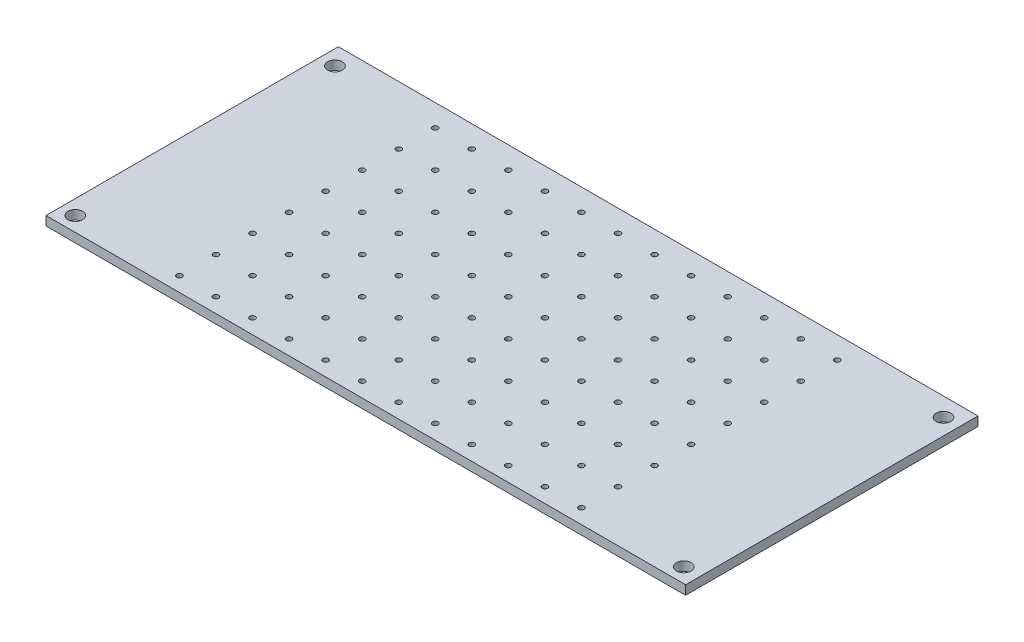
from build123d import *

# Parameters (mm, degrees)
CROQUIS1_W                = 350
CROQUIS1_H                = 160
SALIENTE_EXTRUIR1_DEPTH   = 5
CROQUIS2_R                = 1.5
CORTAR_EXTRUIR1_DEPTH     = 5
MATRIZL1_COUNT            = 12
MATRIZL1_PITCH            = 20
MATRIZL2_COUNT            = 8
MATRIZL2_PITCH            = 20
MATRIZL2_COPY_1_SKETCH_R  = 1.5
MATRIZL2_COPY_1_DEPTH     = 5
MATRIZL2_COPY_2_SKETCH_R  = 1.5
MATRIZL2_COPY_2_DEPTH     = 5
MATRIZL2_COPY_3_SKETCH_R  = 1.5
MATRIZL2_COPY_3_DEPTH     = 5
MATRIZL2_COPY_4_SKETCH_R  = 1.5
MATRIZL2_COPY_4_DEPTH     = 5
MATRIZL2_COPY_5_SKETCH_R  = 1.5
MATRIZL2_COPY_5_DEPTH     = 5
MATRIZL2_COPY_6_SKETCH_R  = 1.5
MATRIZL2_COPY_6_DEPTH     = 5
MATRIZL2_COPY_7_SKETCH_R  = 1.5
MATRIZL2_COPY_7_DEPTH     = 5
MATRIZL2_COPY_8_SKETCH_R  = 1.5
MATRIZL2_COPY_8_DEPTH     = 5
MATRIZL2_COPY_9_SKETCH_R  = 1.5
MATRIZL2_COPY_9_DEPTH     = 5
MATRIZL2_COPY_10_SKETCH_R = 1.5
MATRIZL2_COPY_10_DEPTH    = 5
MATRIZL2_COPY_11_SKETCH_R = 1.5
MATRIZL2_COPY_11_DEPTH    = 5
MATRIZL2_COPY_12_SKETCH_R = 1.5
MATRIZL2_COPY_12_DEPTH    = 5
MATRIZL2_COPY_13_SKETCH_R = 1.5
MATRIZL2_COPY_13_DEPTH    = 5
MATRIZL2_COPY_14_SKETCH_R = 1.5
MATRIZL2_COPY_14_DEPTH    = 5
MATRIZL2_COPY_15_SKETCH_R = 1.5
MATRIZL2_COPY_15_DEPTH    = 5
MATRIZL2_COPY_16_SKETCH_R = 1.5
MATRIZL2_COPY_16_DEPTH    = 5
MATRIZL2_COPY_17_SKETCH_R = 1.5
MATRIZL2_COPY_17_DEPTH    = 5
MATRIZL2_COPY_18_SKETCH_R = 1.5
MATRIZL2_COPY_18_DEPTH    = 5
MATRIZL2_COPY_19_SKETCH_R = 1.5
MATRIZL2_COPY_19_DEPTH    = 5
MATRIZL2_COPY_20_SKETCH_R = 1.5
MATRIZL2_COPY_20_DEPTH    = 5
MATRIZL2_COPY_21_SKETCH_R = 1.5
MATRIZL2_COPY_21_DEPTH    = 5
MATRIZL2_COPY_22_SKETCH_R = 1.5
MATRIZL2_COPY_22_DEPTH    = 5
MATRIZL2_COPY_23_SKETCH_R = 1.5
MATRIZL2_COPY_23_DEPTH    = 5
MATRIZL2_COPY_24_SKETCH_R = 1.5
MATRIZL2_COPY_24_DEPTH    = 5
MATRIZL2_COPY_25_SKETCH_R = 1.5
MATRIZL2_COPY_25_DEPTH    = 5
MATRIZL2_COPY_26_SKETCH_R = 1.5
MATRIZL2_COPY_26_DEPTH    = 5
MATRIZL2_COPY_27_SKETCH_R = 1.5
MATRIZL2_COPY_27_DEPTH    = 5
MATRIZL2_COPY_28_SKETCH_R = 1.5
MATRIZL2_COPY_28_DEPTH    = 5
MATRIZL2_COPY_29_SKETCH_R = 1.5
MATRIZL2_COPY_29_DEPTH    = 5
MATRIZL2_COPY_30_SKETCH_R = 1.5
MATRIZL2_COPY_30_DEPTH    = 5
MATRIZL2_COPY_31_SKETCH_R = 1.5
MATRIZL2_COPY_31_DEPTH    = 5
MATRIZL2_COPY_32_SKETCH_R = 1.5
MATRIZL2_COPY_32_DEPTH    = 5
MATRIZL2_COPY_33_SKETCH_R = 1.5
MATRIZL2_COPY_33_DEPTH    = 5
MATRIZL2_COPY_34_SKETCH_R = 1.5
MATRIZL2_COPY_34_DEPTH    = 5
MATRIZL2_COPY_35_SKETCH_R = 1.5
MATRIZL2_COPY_35_DEPTH    = 5
MATRIZL2_COPY_36_SKETCH_R = 1.5
MATRIZL2_COPY_36_DEPTH    = 5
MATRIZL2_COPY_37_SKETCH_R = 1.5
MATRIZL2_COPY_37_DEPTH    = 5
MATRIZL2_COPY_38_SKETCH_R = 1.5
MATRIZL2_COPY_38_DEPTH    = 5
MATRIZL2_COPY_39_SKETCH_R = 1.5
MATRIZL2_COPY_39_DEPTH    = 5
MATRIZL2_COPY_40_SKETCH_R = 1.5
MATRIZL2_COPY_40_DEPTH    = 5
MATRIZL2_COPY_41_SKETCH_R = 1.5
MATRIZL2_COPY_41_DEPTH    = 5
MATRIZL2_COPY_42_SKETCH_R = 1.5
MATRIZL2_COPY_42_DEPTH    = 5
MATRIZL2_COPY_43_SKETCH_R = 1.5
MATRIZL2_COPY_43_DEPTH    = 5
MATRIZL2_COPY_44_SKETCH_R = 1.5
MATRIZL2_COPY_44_DEPTH    = 5
MATRIZL2_COPY_45_SKETCH_R = 1.5
MATRIZL2_COPY_45_DEPTH    = 5
MATRIZL2_COPY_46_SKETCH_R = 1.5
MATRIZL2_COPY_46_DEPTH    = 5
MATRIZL2_COPY_47_SKETCH_R = 1.5
MATRIZL2_COPY_47_DEPTH    = 5
MATRIZL2_COPY_48_SKETCH_R = 1.5
MATRIZL2_COPY_48_DEPTH    = 5
MATRIZL2_COPY_49_SKETCH_R = 1.5
MATRIZL2_COPY_49_DEPTH    = 5
MATRIZL2_COPY_50_SKETCH_R = 1.5
MATRIZL2_COPY_50_DEPTH    = 5
MATRIZL2_COPY_51_SKETCH_R = 1.5
MATRIZL2_COPY_51_DEPTH    = 5
MATRIZL2_COPY_52_SKETCH_R = 1.5
MATRIZL2_COPY_52_DEPTH    = 5
MATRIZL2_COPY_53_SKETCH_R = 1.5
MATRIZL2_COPY_53_DEPTH    = 5
MATRIZL2_COPY_54_SKETCH_R = 1.5
MATRIZL2_COPY_54_DEPTH    = 5
MATRIZL2_COPY_55_SKETCH_R = 1.5
MATRIZL2_COPY_55_DEPTH    = 5
MATRIZL2_COPY_56_SKETCH_R = 1.5
MATRIZL2_COPY_56_DEPTH    = 5
MATRIZL2_COPY_57_SKETCH_R = 1.5
MATRIZL2_COPY_57_DEPTH    = 5
MATRIZL2_COPY_58_SKETCH_R = 1.5
MATRIZL2_COPY_58_DEPTH    = 5
MATRIZL2_COPY_59_SKETCH_R = 1.5
MATRIZL2_COPY_59_DEPTH    = 5
MATRIZL2_COPY_60_SKETCH_R = 1.5
MATRIZL2_COPY_60_DEPTH    = 5
MATRIZL2_COPY_61_SKETCH_R = 1.5
MATRIZL2_COPY_61_DEPTH    = 5
MATRIZL2_COPY_62_SKETCH_R = 1.5
MATRIZL2_COPY_62_DEPTH    = 5
MATRIZL2_COPY_63_SKETCH_R = 1.5
MATRIZL2_COPY_63_DEPTH    = 5
MATRIZL2_COPY_64_SKETCH_R = 1.5
MATRIZL2_COPY_64_DEPTH    = 5
MATRIZL2_COPY_65_SKETCH_R = 1.5
MATRIZL2_COPY_65_DEPTH    = 5
MATRIZL2_COPY_66_SKETCH_R = 1.5
MATRIZL2_COPY_66_DEPTH    = 5
MATRIZL2_COPY_67_SKETCH_R = 1.5
MATRIZL2_COPY_67_DEPTH    = 5
MATRIZL2_COPY_68_SKETCH_R = 1.5
MATRIZL2_COPY_68_DEPTH    = 5
MATRIZL2_COPY_69_SKETCH_R = 1.5
MATRIZL2_COPY_69_DEPTH    = 5
MATRIZL2_COPY_70_SKETCH_R = 1.5
MATRIZL2_COPY_70_DEPTH    = 5
MATRIZL2_COPY_71_SKETCH_R = 1.5
MATRIZL2_COPY_71_DEPTH    = 5
MATRIZL2_COPY_72_SKETCH_R = 1.5
MATRIZL2_COPY_72_DEPTH    = 5
MATRIZL2_COPY_73_SKETCH_R = 1.5
MATRIZL2_COPY_73_DEPTH    = 5
MATRIZL2_COPY_74_SKETCH_R = 1.5
MATRIZL2_COPY_74_DEPTH    = 5
MATRIZL2_COPY_75_SKETCH_R = 1.5
MATRIZL2_COPY_75_DEPTH    = 5
MATRIZL2_COPY_76_SKETCH_R = 1.5
MATRIZL2_COPY_76_DEPTH    = 5
MATRIZL2_COPY_77_SKETCH_R = 1.5
MATRIZL2_COPY_77_DEPTH    = 5
CROQUIS3_R                = 4
CORTAR_EXTRUIR2_DEPTH     = 5
CROQUIS5_R                = 4
CORTAR_EXTRUIR3_DEPTH     = 5
MATRIZL3_COUNT            = 2
MATRIZL3_PITCH            = 333


with BuildPart() as part:
    # Croquis1 → Saliente-Extruir1 (new body)
    with BuildSketch(Plane(origin=(0, 0, 0), x_dir=(1, 0, 0), z_dir=(0, 1, 0))):
        Rectangle(CROQUIS1_W, CROQUIS1_H)
    extrude(amount=SALIENTE_EXTRUIR1_DEPTH)

    # Croquis2 → Cortar-Extruir1 (cut)
    with BuildSketch(Plane(origin=(0, 5, 0), x_dir=(1, 0, 0), z_dir=(0, 1, 0))):
        with Locations(Location((-110, 68, 0), (0, 0, 270))):
            Circle(CROQUIS2_R)
    cortar_extruir1 = extrude(amount=-CORTAR_EXTRUIR1_DEPTH, mode=Mode.SUBTRACT)

    # MatrizL1: Cortar-Extruir1 ×12
    with Locations(*[(i * MATRIZL1_PITCH, 0, 0) for i in range(1, MATRIZL1_COUNT)]):
        add(cortar_extruir1, mode=Mode.SUBTRACT)

    # MatrizL2: Cortar-Extruir1 ×8
    with Locations(*[(0, 0, i * MATRIZL2_PITCH) for i in range(1, MATRIZL2_COUNT)]):
        add(cortar_extruir1, mode=Mode.SUBTRACT)

    # MatrizL2 copy 1 sketch → MatrizL2 copy 1 (cut)
    with BuildSketch(Plane(origin=(20, 5, 20), x_dir=(1, 0, 0), z_dir=(0, 1, 0))):
        with Locations(Location((-110, 68, 0), (0, 0, 270))):
            Circle(MATRIZL2_COPY_1_SKETCH_R)
    extrude(amount=-MATRIZL2_COPY_1_DEPTH, mode=Mode.SUBTRACT)

    # MatrizL2 copy 2 sketch → MatrizL2 copy 2 (cut)
    with BuildSketch(Plane(origin=(20, 5, 40), x_dir=(1, 0, 0), z_dir=(0, 1, 0))):
        with Locations(Location((-110, 68, 0), (0, 0, 270))):
            Circle(MATRIZL2_COPY_2_SKETCH_R)
    extrude(amount=-MATRIZL2_COPY_2_DEPTH, mode=Mode.SUBTRACT)

    # MatrizL2 copy 3 sketch → MatrizL2 copy 3 (cut)
    with BuildSketch(Plane(origin=(20, 5, 60), x_dir=(1, 0, 0), z_dir=(0, 1, 0))):
        with Locations(Location((-110, 68, 0), (0, 0, 270))):
            Circle(MATRIZL2_COPY_3_SKETCH_R)
    extrude(amount=-MATRIZL2_COPY_3_DEPTH, mode=Mode.SUBTRACT)

    # MatrizL2 copy 4 sketch → MatrizL2 copy 4 (cut)
    with BuildSketch(Plane(origin=(20, 5, 80), x_dir=(1, 0, 0), z_dir=(0, 1, 0))):
        with Locations(Location((-110, 68, 0), (0, 0, 270))):
            Circle(MATRIZL2_COPY_4_SKETCH_R)
    extrude(amount=-MATRIZL2_COPY_4_DEPTH, mode=Mode.SUBTRACT)

    # MatrizL2 copy 5 sketch → MatrizL2 copy 5 (cut)
    with BuildSketch(Plane(origin=(20, 5, 100), x_dir=(1, 0, 0), z_dir=(0, 1, 0))):
        with Locations(Location((-110, 68, 0), (0, 0, 270))):
            Circle(MATRIZL2_COPY_5_SKETCH_R)
    extrude(amount=-MATRIZL2_COPY_5_DEPTH, mode=Mode.SUBTRACT)

    # MatrizL2 copy 6 sketch → MatrizL2 copy 6 (cut)
    with BuildSketch(Plane(origin=(20, 5, 120), x_dir=(1, 0, 0), z_dir=(0, 1, 0))):
        with Locations(Location((-110, 68, 0), (0, 0, 270))):
            Circle(MATRIZL2_COPY_6_SKETCH_R)
    extrude(amount=-MATRIZL2_COPY_6_DEPTH, mode=Mode.SUBTRACT)

    # MatrizL2 copy 7 sketch → MatrizL2 copy 7 (cut)
    with BuildSketch(Plane(origin=(20, 5, 140), x_dir=(1, 0, 0), z_dir=(0, 1, 0))):
        with Locations(Location((-110, 68, 0), (0, 0, 270))):
            Circle(MATRIZL2_COPY_7_SKETCH_R)
    extrude(amount=-MATRIZL2_COPY_7_DEPTH, mode=Mode.SUBTRACT)

    # MatrizL2 copy 8 sketch → MatrizL2 copy 8 (cut)
    with BuildSketch(Plane(origin=(40, 5, 20), x_dir=(1, 0, 0), z_dir=(0, 1, 0))):
        with Locations(Location((-110, 68, 0), (0, 0, 270))):
            Circle(MATRIZL2_COPY_8_SKETCH_R)
    extrude(amount=-MATRIZL2_COPY_8_DEPTH, mode=Mode.SUBTRACT)

    # MatrizL2 copy 9 sketch → MatrizL2 copy 9 (cut)
    with BuildSketch(Plane(origin=(40, 5, 40), x_dir=(1, 0, 0), z_dir=(0, 1, 0))):
        with Locations(Location((-110, 68, 0), (0, 0, 270))):
            Circle(MATRIZL2_COPY_9_SKETCH_R)
    extrude(amount=-MATRIZL2_COPY_9_DEPTH, mode=Mode.SUBTRACT)

    # MatrizL2 copy 10 sketch → MatrizL2 copy 10 (cut)
    with BuildSketch(Plane(origin=(40, 5, 60), x_dir=(1, 0, 0), z_dir=(0, 1, 0))):
        with Locations(Location((-110, 68, 0), (0, 0, 270))):
            Circle(MATRIZL2_COPY_10_SKETCH_R)
    extrude(amount=-MATRIZL2_COPY_10_DEPTH, mode=Mode.SUBTRACT)

    # MatrizL2 copy 11 sketch → MatrizL2 copy 11 (cut)
    with BuildSketch(Plane(origin=(40, 5, 80), x_dir=(1, 0, 0), z_dir=(0, 1, 0))):
        with Locations(Location((-110, 68, 0), (0, 0, 270))):
            Circle(MATRIZL2_COPY_11_SKETCH_R)
    extrude(amount=-MATRIZL2_COPY_11_DEPTH, mode=Mode.SUBTRACT)

    # MatrizL2 copy 12 sketch → MatrizL2 copy 12 (cut)
    with BuildSketch(Plane(origin=(40, 5, 100), x_dir=(1, 0, 0), z_dir=(0, 1, 0))):
        with Locations(Location((-110, 68, 0), (0, 0, 270))):
            Circle(MATRIZL2_COPY_12_SKETCH_R)
    extrude(amount=-MATRIZL2_COPY_12_DEPTH, mode=Mode.SUBTRACT)

    # MatrizL2 copy 13 sketch → MatrizL2 copy 13 (cut)
    with BuildSketch(Plane(origin=(40, 5, 120), x_dir=(1, 0, 0), z_dir=(0, 1, 0))):
        with Locations(Location((-110, 68, 0), (0, 0, 270))):
            Circle(MATRIZL2_COPY_13_SKETCH_R)
    extrude(amount=-MATRIZL2_COPY_13_DEPTH, mode=Mode.SUBTRACT)

    # MatrizL2 copy 14 sketch → MatrizL2 copy 14 (cut)
    with BuildSketch(Plane(origin=(40, 5, 140), x_dir=(1, 0, 0), z_dir=(0, 1, 0))):
        with Locations(Location((-110, 68, 0), (0, 0, 270))):
            Circle(MATRIZL2_COPY_14_SKETCH_R)
    extrude(amount=-MATRIZL2_COPY_14_DEPTH, mode=Mode.SUBTRACT)

    # MatrizL2 copy 15 sketch → MatrizL2 copy 15 (cut)
    with BuildSketch(Plane(origin=(60, 5, 20), x_dir=(1, 0, 0), z_dir=(0, 1, 0))):
        with Locations(Location((-110, 68, 0), (0, 0, 270))):
            Circle(MATRIZL2_COPY_15_SKETCH_R)
    extrude(amount=-MATRIZL2_COPY_15_DEPTH, mode=Mode.SUBTRACT)

    # MatrizL2 copy 16 sketch → MatrizL2 copy 16 (cut)
    with BuildSketch(Plane(origin=(60, 5, 40), x_dir=(1, 0, 0), z_dir=(0, 1, 0))):
        with Locations(Location((-110, 68, 0), (0, 0, 270))):
            Circle(MATRIZL2_COPY_16_SKETCH_R)
    extrude(amount=-MATRIZL2_COPY_16_DEPTH, mode=Mode.SUBTRACT)

    # MatrizL2 copy 17 sketch → MatrizL2 copy 17 (cut)
    with BuildSketch(Plane(origin=(60, 5, 60), x_dir=(1, 0, 0), z_dir=(0, 1, 0))):
        with Locations(Location((-110, 68, 0), (0, 0, 270))):
            Circle(MATRIZL2_COPY_17_SKETCH_R)
    extrude(amount=-MATRIZL2_COPY_17_DEPTH, mode=Mode.SUBTRACT)

    # MatrizL2 copy 18 sketch → MatrizL2 copy 18 (cut)
    with BuildSketch(Plane(origin=(60, 5, 80), x_dir=(1, 0, 0), z_dir=(0, 1, 0))):
        with Locations(Location((-110, 68, 0), (0, 0, 270))):
            Circle(MATRIZL2_COPY_18_SKETCH_R)
    extrude(amount=-MATRIZL2_COPY_18_DEPTH, mode=Mode.SUBTRACT)

    # MatrizL2 copy 19 sketch → MatrizL2 copy 19 (cut)
    with BuildSketch(Plane(origin=(60, 5, 100), x_dir=(1, 0, 0), z_dir=(0, 1, 0))):
        with Locations(Location((-110, 68, 0), (0, 0, 270))):
            Circle(MATRIZL2_COPY_19_SKETCH_R)
    extrude(amount=-MATRIZL2_COPY_19_DEPTH, mode=Mode.SUBTRACT)

    # MatrizL2 copy 20 sketch → MatrizL2 copy 20 (cut)
    with BuildSketch(Plane(origin=(60, 5, 120), x_dir=(1, 0, 0), z_dir=(0, 1, 0))):
        with Locations(Location((-110, 68, 0), (0, 0, 270))):
            Circle(MATRIZL2_COPY_20_SKETCH_R)
    extrude(amount=-MATRIZL2_COPY_20_DEPTH, mode=Mode.SUBTRACT)

    # MatrizL2 copy 21 sketch → MatrizL2 copy 21 (cut)
    with BuildSketch(Plane(origin=(60, 5, 140), x_dir=(1, 0, 0), z_dir=(0, 1, 0))):
        with Locations(Location((-110, 68, 0), (0, 0, 270))):
            Circle(MATRIZL2_COPY_21_SKETCH_R)
    extrude(amount=-MATRIZL2_COPY_21_DEPTH, mode=Mode.SUBTRACT)

    # MatrizL2 copy 22 sketch → MatrizL2 copy 22 (cut)
    with BuildSketch(Plane(origin=(80, 5, 20), x_dir=(1, 0, 0), z_dir=(0, 1, 0))):
        with Locations(Location((-110, 68, 0), (0, 0, 270))):
            Circle(MATRIZL2_COPY_22_SKETCH_R)
    extrude(amount=-MATRIZL2_COPY_22_DEPTH, mode=Mode.SUBTRACT)

    # MatrizL2 copy 23 sketch → MatrizL2 copy 23 (cut)
    with BuildSketch(Plane(origin=(80, 5, 40), x_dir=(1, 0, 0), z_dir=(0, 1, 0))):
        with Locations(Location((-110, 68, 0), (0, 0, 270))):
            Circle(MATRIZL2_COPY_23_SKETCH_R)
    extrude(amount=-MATRIZL2_COPY_23_DEPTH, mode=Mode.SUBTRACT)

    # MatrizL2 copy 24 sketch → MatrizL2 copy 24 (cut)
    with BuildSketch(Plane(origin=(80, 5, 60), x_dir=(1, 0, 0), z_dir=(0, 1, 0))):
        with Locations(Location((-110, 68, 0), (0, 0, 270))):
            Circle(MATRIZL2_COPY_24_SKETCH_R)
    extrude(amount=-MATRIZL2_COPY_24_DEPTH, mode=Mode.SUBTRACT)

    # MatrizL2 copy 25 sketch → MatrizL2 copy 25 (cut)
    with BuildSketch(Plane(origin=(80, 5, 80), x_dir=(1, 0, 0), z_dir=(0, 1, 0))):
        with Locations(Location((-110, 68, 0), (0, 0, 270))):
            Circle(MATRIZL2_COPY_25_SKETCH_R)
    extrude(amount=-MATRIZL2_COPY_25_DEPTH, mode=Mode.SUBTRACT)

    # MatrizL2 copy 26 sketch → MatrizL2 copy 26 (cut)
    with BuildSketch(Plane(origin=(80, 5, 100), x_dir=(1, 0, 0), z_dir=(0, 1, 0))):
        with Locations(Location((-110, 68, 0), (0, 0, 270))):
            Circle(MATRIZL2_COPY_26_SKETCH_R)
    extrude(amount=-MATRIZL2_COPY_26_DEPTH, mode=Mode.SUBTRACT)

    # MatrizL2 copy 27 sketch → MatrizL2 copy 27 (cut)
    with BuildSketch(Plane(origin=(80, 5, 120), x_dir=(1, 0, 0), z_dir=(0, 1, 0))):
        with Locations(Location((-110, 68, 0), (0, 0, 270))):
            Circle(MATRIZL2_COPY_27_SKETCH_R)
    extrude(amount=-MATRIZL2_COPY_27_DEPTH, mode=Mode.SUBTRACT)

    # MatrizL2 copy 28 sketch → MatrizL2 copy 28 (cut)
    with BuildSketch(Plane(origin=(80, 5, 140), x_dir=(1, 0, 0), z_dir=(0, 1, 0))):
        with Locations(Location((-110, 68, 0), (0, 0, 270))):
            Circle(MATRIZL2_COPY_28_SKETCH_R)
    extrude(amount=-MATRIZL2_COPY_28_DEPTH, mode=Mode.SUBTRACT)

    # MatrizL2 copy 29 sketch → MatrizL2 copy 29 (cut)
    with BuildSketch(Plane(origin=(100, 5, 20), x_dir=(1, 0, 0), z_dir=(0, 1, 0))):
        with Locations(Location((-110, 68, 0), (0, 0, 270))):
            Circle(MATRIZL2_COPY_29_SKETCH_R)
    extrude(amount=-MATRIZL2_COPY_29_DEPTH, mode=Mode.SUBTRACT)

    # MatrizL2 copy 30 sketch → MatrizL2 copy 30 (cut)
    with BuildSketch(Plane(origin=(100, 5, 40), x_dir=(1, 0, 0), z_dir=(0, 1, 0))):
        with Locations(Location((-110, 68, 0), (0, 0, 270))):
            Circle(MATRIZL2_COPY_30_SKETCH_R)
    extrude(amount=-MATRIZL2_COPY_30_DEPTH, mode=Mode.SUBTRACT)

    # MatrizL2 copy 31 sketch → MatrizL2 copy 31 (cut)
    with BuildSketch(Plane(origin=(100, 5, 60), x_dir=(1, 0, 0), z_dir=(0, 1, 0))):
        with Locations(Location((-110, 68, 0), (0, 0, 270))):
            Circle(MATRIZL2_COPY_31_SKETCH_R)
    extrude(amount=-MATRIZL2_COPY_31_DEPTH, mode=Mode.SUBTRACT)

    # MatrizL2 copy 32 sketch → MatrizL2 copy 32 (cut)
    with BuildSketch(Plane(origin=(100, 5, 80), x_dir=(1, 0, 0), z_dir=(0, 1, 0))):
        with Locations(Location((-110, 68, 0), (0, 0, 270))):
            Circle(MATRIZL2_COPY_32_SKETCH_R)
    extrude(amount=-MATRIZL2_COPY_32_DEPTH, mode=Mode.SUBTRACT)

    # MatrizL2 copy 33 sketch → MatrizL2 copy 33 (cut)
    with BuildSketch(Plane(origin=(100, 5, 100), x_dir=(1, 0, 0), z_dir=(0, 1, 0))):
        with Locations(Location((-110, 68, 0), (0, 0, 270))):
            Circle(MATRIZL2_COPY_33_SKETCH_R)
    extrude(amount=-MATRIZL2_COPY_33_DEPTH, mode=Mode.SUBTRACT)

    # MatrizL2 copy 34 sketch → MatrizL2 copy 34 (cut)
    with BuildSketch(Plane(origin=(100, 5, 120), x_dir=(1, 0, 0), z_dir=(0, 1, 0))):
        with Locations(Location((-110, 68, 0), (0, 0, 270))):
            Circle(MATRIZL2_COPY_34_SKETCH_R)
    extrude(amount=-MATRIZL2_COPY_34_DEPTH, mode=Mode.SUBTRACT)

    # MatrizL2 copy 35 sketch → MatrizL2 copy 35 (cut)
    with BuildSketch(Plane(origin=(100, 5, 140), x_dir=(1, 0, 0), z_dir=(0, 1, 0))):
        with Locations(Location((-110, 68, 0), (0, 0, 270))):
            Circle(MATRIZL2_COPY_35_SKETCH_R)
    extrude(amount=-MATRIZL2_COPY_35_DEPTH, mode=Mode.SUBTRACT)

    # MatrizL2 copy 36 sketch → MatrizL2 copy 36 (cut)
    with BuildSketch(Plane(origin=(120, 5, 20), x_dir=(1, 0, 0), z_dir=(0, 1, 0))):
        with Locations(Location((-110, 68, 0), (0, 0, 270))):
            Circle(MATRIZL2_COPY_36_SKETCH_R)
    extrude(amount=-MATRIZL2_COPY_36_DEPTH, mode=Mode.SUBTRACT)

    # MatrizL2 copy 37 sketch → MatrizL2 copy 37 (cut)
    with BuildSketch(Plane(origin=(120, 5, 40), x_dir=(1, 0, 0), z_dir=(0, 1, 0))):
        with Locations(Location((-110, 68, 0), (0, 0, 270))):
            Circle(MATRIZL2_COPY_37_SKETCH_R)
    extrude(amount=-MATRIZL2_COPY_37_DEPTH, mode=Mode.SUBTRACT)

    # MatrizL2 copy 38 sketch → MatrizL2 copy 38 (cut)
    with BuildSketch(Plane(origin=(120, 5, 60), x_dir=(1, 0, 0), z_dir=(0, 1, 0))):
        with Locations(Location((-110, 68, 0), (0, 0, 270))):
            Circle(MATRIZL2_COPY_38_SKETCH_R)
    extrude(amount=-MATRIZL2_COPY_38_DEPTH, mode=Mode.SUBTRACT)

    # MatrizL2 copy 39 sketch → MatrizL2 copy 39 (cut)
    with BuildSketch(Plane(origin=(120, 5, 80), x_dir=(1, 0, 0), z_dir=(0, 1, 0))):
        with Locations(Location((-110, 68, 0), (0, 0, 270))):
            Circle(MATRIZL2_COPY_39_SKETCH_R)
    extrude(amount=-MATRIZL2_COPY_39_DEPTH, mode=Mode.SUBTRACT)

    # MatrizL2 copy 40 sketch → MatrizL2 copy 40 (cut)
    with BuildSketch(Plane(origin=(120, 5, 100), x_dir=(1, 0, 0), z_dir=(0, 1, 0))):
        with Locations(Location((-110, 68, 0), (0, 0, 270))):
            Circle(MATRIZL2_COPY_40_SKETCH_R)
    extrude(amount=-MATRIZL2_COPY_40_DEPTH, mode=Mode.SUBTRACT)

    # MatrizL2 copy 41 sketch → MatrizL2 copy 41 (cut)
    with BuildSketch(Plane(origin=(120, 5, 120), x_dir=(1, 0, 0), z_dir=(0, 1, 0))):
        with Locations(Location((-110, 68, 0), (0, 0, 270))):
            Circle(MATRIZL2_COPY_41_SKETCH_R)
    extrude(amount=-MATRIZL2_COPY_41_DEPTH, mode=Mode.SUBTRACT)

    # MatrizL2 copy 42 sketch → MatrizL2 copy 42 (cut)
    with BuildSketch(Plane(origin=(120, 5, 140), x_dir=(1, 0, 0), z_dir=(0, 1, 0))):
        with Locations(Location((-110, 68, 0), (0, 0, 270))):
            Circle(MATRIZL2_COPY_42_SKETCH_R)
    extrude(amount=-MATRIZL2_COPY_42_DEPTH, mode=Mode.SUBTRACT)

    # MatrizL2 copy 43 sketch → MatrizL2 copy 43 (cut)
    with BuildSketch(Plane(origin=(140, 5, 20), x_dir=(1, 0, 0), z_dir=(0, 1, 0))):
        with Locations(Location((-110, 68, 0), (0, 0, 270))):
            Circle(MATRIZL2_COPY_43_SKETCH_R)
    extrude(amount=-MATRIZL2_COPY_43_DEPTH, mode=Mode.SUBTRACT)

    # MatrizL2 copy 44 sketch → MatrizL2 copy 44 (cut)
    with BuildSketch(Plane(origin=(140, 5, 40), x_dir=(1, 0, 0), z_dir=(0, 1, 0))):
        with Locations(Location((-110, 68, 0), (0, 0, 270))):
            Circle(MATRIZL2_COPY_44_SKETCH_R)
    extrude(amount=-MATRIZL2_COPY_44_DEPTH, mode=Mode.SUBTRACT)

    # MatrizL2 copy 45 sketch → MatrizL2 copy 45 (cut)
    with BuildSketch(Plane(origin=(140, 5, 60), x_dir=(1, 0, 0), z_dir=(0, 1, 0))):
        with Locations(Location((-110, 68, 0), (0, 0, 270))):
            Circle(MATRIZL2_COPY_45_SKETCH_R)
    extrude(amount=-MATRIZL2_COPY_45_DEPTH, mode=Mode.SUBTRACT)

    # MatrizL2 copy 46 sketch → MatrizL2 copy 46 (cut)
    with BuildSketch(Plane(origin=(140, 5, 80), x_dir=(1, 0, 0), z_dir=(0, 1, 0))):
        with Locations(Location((-110, 68, 0), (0, 0, 270))):
            Circle(MATRIZL2_COPY_46_SKETCH_R)
    extrude(amount=-MATRIZL2_COPY_46_DEPTH, mode=Mode.SUBTRACT)

    # MatrizL2 copy 47 sketch → MatrizL2 copy 47 (cut)
    with BuildSketch(Plane(origin=(140, 5, 100), x_dir=(1, 0, 0), z_dir=(0, 1, 0))):
        with Locations(Location((-110, 68, 0), (0, 0, 270))):
            Circle(MATRIZL2_COPY_47_SKETCH_R)
    extrude(amount=-MATRIZL2_COPY_47_DEPTH, mode=Mode.SUBTRACT)

    # MatrizL2 copy 48 sketch → MatrizL2 copy 48 (cut)
    with BuildSketch(Plane(origin=(140, 5, 120), x_dir=(1, 0, 0), z_dir=(0, 1, 0))):
        with Locations(Location((-110, 68, 0), (0, 0, 270))):
            Circle(MATRIZL2_COPY_48_SKETCH_R)
    extrude(amount=-MATRIZL2_COPY_48_DEPTH, mode=Mode.SUBTRACT)

    # MatrizL2 copy 49 sketch → MatrizL2 copy 49 (cut)
    with BuildSketch(Plane(origin=(140, 5, 140), x_dir=(1, 0, 0), z_dir=(0, 1, 0))):
        with Locations(Location((-110, 68, 0), (0, 0, 270))):
            Circle(MATRIZL2_COPY_49_SKETCH_R)
    extrude(amount=-MATRIZL2_COPY_49_DEPTH, mode=Mode.SUBTRACT)

    # MatrizL2 copy 50 sketch → MatrizL2 copy 50 (cut)
    with BuildSketch(Plane(origin=(160, 5, 20), x_dir=(1, 0, 0), z_dir=(0, 1, 0))):
        with Locations(Location((-110, 68, 0), (0, 0, 270))):
            Circle(MATRIZL2_COPY_50_SKETCH_R)
    extrude(amount=-MATRIZL2_COPY_50_DEPTH, mode=Mode.SUBTRACT)

    # MatrizL2 copy 51 sketch → MatrizL2 copy 51 (cut)
    with BuildSketch(Plane(origin=(160, 5, 40), x_dir=(1, 0, 0), z_dir=(0, 1, 0))):
        with Locations(Location((-110, 68, 0), (0, 0, 270))):
            Circle(MATRIZL2_COPY_51_SKETCH_R)
    extrude(amount=-MATRIZL2_COPY_51_DEPTH, mode=Mode.SUBTRACT)

    # MatrizL2 copy 52 sketch → MatrizL2 copy 52 (cut)
    with BuildSketch(Plane(origin=(160, 5, 60), x_dir=(1, 0, 0), z_dir=(0, 1, 0))):
        with Locations(Location((-110, 68, 0), (0, 0, 270))):
            Circle(MATRIZL2_COPY_52_SKETCH_R)
    extrude(amount=-MATRIZL2_COPY_52_DEPTH, mode=Mode.SUBTRACT)

    # MatrizL2 copy 53 sketch → MatrizL2 copy 53 (cut)
    with BuildSketch(Plane(origin=(160, 5, 80), x_dir=(1, 0, 0), z_dir=(0, 1, 0))):
        with Locations(Location((-110, 68, 0), (0, 0, 270))):
            Circle(MATRIZL2_COPY_53_SKETCH_R)
    extrude(amount=-MATRIZL2_COPY_53_DEPTH, mode=Mode.SUBTRACT)

    # MatrizL2 copy 54 sketch → MatrizL2 copy 54 (cut)
    with BuildSketch(Plane(origin=(160, 5, 100), x_dir=(1, 0, 0), z_dir=(0, 1, 0))):
        with Locations(Location((-110, 68, 0), (0, 0, 270))):
            Circle(MATRIZL2_COPY_54_SKETCH_R)
    extrude(amount=-MATRIZL2_COPY_54_DEPTH, mode=Mode.SUBTRACT)

    # MatrizL2 copy 55 sketch → MatrizL2 copy 55 (cut)
    with BuildSketch(Plane(origin=(160, 5, 120), x_dir=(1, 0, 0), z_dir=(0, 1, 0))):
        with Locations(Location((-110, 68, 0), (0, 0, 270))):
            Circle(MATRIZL2_COPY_55_SKETCH_R)
    extrude(amount=-MATRIZL2_COPY_55_DEPTH, mode=Mode.SUBTRACT)

    # MatrizL2 copy 56 sketch → MatrizL2 copy 56 (cut)
    with BuildSketch(Plane(origin=(160, 5, 140), x_dir=(1, 0, 0), z_dir=(0, 1, 0))):
        with Locations(Location((-110, 68, 0), (0, 0, 270))):
            Circle(MATRIZL2_COPY_56_SKETCH_R)
    extrude(amount=-MATRIZL2_COPY_56_DEPTH, mode=Mode.SUBTRACT)

    # MatrizL2 copy 57 sketch → MatrizL2 copy 57 (cut)
    with BuildSketch(Plane(origin=(180, 5, 20), x_dir=(1, 0, 0), z_dir=(0, 1, 0))):
        with Locations(Location((-110, 68, 0), (0, 0, 270))):
            Circle(MATRIZL2_COPY_57_SKETCH_R)
    extrude(amount=-MATRIZL2_COPY_57_DEPTH, mode=Mode.SUBTRACT)

    # MatrizL2 copy 58 sketch → MatrizL2 copy 58 (cut)
    with BuildSketch(Plane(origin=(180, 5, 40), x_dir=(1, 0, 0), z_dir=(0, 1, 0))):
        with Locations(Location((-110, 68, 0), (0, 0, 270))):
            Circle(MATRIZL2_COPY_58_SKETCH_R)
    extrude(amount=-MATRIZL2_COPY_58_DEPTH, mode=Mode.SUBTRACT)

    # MatrizL2 copy 59 sketch → MatrizL2 copy 59 (cut)
    with BuildSketch(Plane(origin=(180, 5, 60), x_dir=(1, 0, 0), z_dir=(0, 1, 0))):
        with Locations(Location((-110, 68, 0), (0, 0, 270))):
            Circle(MATRIZL2_COPY_59_SKETCH_R)
    extrude(amount=-MATRIZL2_COPY_59_DEPTH, mode=Mode.SUBTRACT)

    # MatrizL2 copy 60 sketch → MatrizL2 copy 60 (cut)
    with BuildSketch(Plane(origin=(180, 5, 80), x_dir=(1, 0, 0), z_dir=(0, 1, 0))):
        with Locations(Location((-110, 68, 0), (0, 0, 270))):
            Circle(MATRIZL2_COPY_60_SKETCH_R)
    extrude(amount=-MATRIZL2_COPY_60_DEPTH, mode=Mode.SUBTRACT)

    # MatrizL2 copy 61 sketch → MatrizL2 copy 61 (cut)
    with BuildSketch(Plane(origin=(180, 5, 100), x_dir=(1, 0, 0), z_dir=(0, 1, 0))):
        with Locations(Location((-110, 68, 0), (0, 0, 270))):
            Circle(MATRIZL2_COPY_61_SKETCH_R)
    extrude(amount=-MATRIZL2_COPY_61_DEPTH, mode=Mode.SUBTRACT)

    # MatrizL2 copy 62 sketch → MatrizL2 copy 62 (cut)
    with BuildSketch(Plane(origin=(180, 5, 120), x_dir=(1, 0, 0), z_dir=(0, 1, 0))):
        with Locations(Location((-110, 68, 0), (0, 0, 270))):
            Circle(MATRIZL2_COPY_62_SKETCH_R)
    extrude(amount=-MATRIZL2_COPY_62_DEPTH, mode=Mode.SUBTRACT)

    # MatrizL2 copy 63 sketch → MatrizL2 copy 63 (cut)
    with BuildSketch(Plane(origin=(180, 5, 140), x_dir=(1, 0, 0), z_dir=(0, 1, 0))):
        with Locations(Location((-110, 68, 0), (0, 0, 270))):
            Circle(MATRIZL2_COPY_63_SKETCH_R)
    extrude(amount=-MATRIZL2_COPY_63_DEPTH, mode=Mode.SUBTRACT)

    # MatrizL2 copy 64 sketch → MatrizL2 copy 64 (cut)
    with BuildSketch(Plane(origin=(200, 5, 20), x_dir=(1, 0, 0), z_dir=(0, 1, 0))):
        with Locations(Location((-110, 68, 0), (0, 0, 270))):
            Circle(MATRIZL2_COPY_64_SKETCH_R)
    extrude(amount=-MATRIZL2_COPY_64_DEPTH, mode=Mode.SUBTRACT)

    # MatrizL2 copy 65 sketch → MatrizL2 copy 65 (cut)
    with BuildSketch(Plane(origin=(200, 5, 40), x_dir=(1, 0, 0), z_dir=(0, 1, 0))):
        with Locations(Location((-110, 68, 0), (0, 0, 270))):
            Circle(MATRIZL2_COPY_65_SKETCH_R)
    extrude(amount=-MATRIZL2_COPY_65_DEPTH, mode=Mode.SUBTRACT)

    # MatrizL2 copy 66 sketch → MatrizL2 copy 66 (cut)
    with BuildSketch(Plane(origin=(200, 5, 60), x_dir=(1, 0, 0), z_dir=(0, 1, 0))):
        with Locations(Location((-110, 68, 0), (0, 0, 270))):
            Circle(MATRIZL2_COPY_66_SKETCH_R)
    extrude(amount=-MATRIZL2_COPY_66_DEPTH, mode=Mode.SUBTRACT)

    # MatrizL2 copy 67 sketch → MatrizL2 copy 67 (cut)
    with BuildSketch(Plane(origin=(200, 5, 80), x_dir=(1, 0, 0), z_dir=(0, 1, 0))):
        with Locations(Location((-110, 68, 0), (0, 0, 270))):
            Circle(MATRIZL2_COPY_67_SKETCH_R)
    extrude(amount=-MATRIZL2_COPY_67_DEPTH, mode=Mode.SUBTRACT)

    # MatrizL2 copy 68 sketch → MatrizL2 copy 68 (cut)
    with BuildSketch(Plane(origin=(200, 5, 100), x_dir=(1, 0, 0), z_dir=(0, 1, 0))):
        with Locations(Location((-110, 68, 0), (0, 0, 270))):
            Circle(MATRIZL2_COPY_68_SKETCH_R)
    extrude(amount=-MATRIZL2_COPY_68_DEPTH, mode=Mode.SUBTRACT)

    # MatrizL2 copy 69 sketch → MatrizL2 copy 69 (cut)
    with BuildSketch(Plane(origin=(200, 5, 120), x_dir=(1, 0, 0), z_dir=(0, 1, 0))):
        with Locations(Location((-110, 68, 0), (0, 0, 270))):
            Circle(MATRIZL2_COPY_69_SKETCH_R)
    extrude(amount=-MATRIZL2_COPY_69_DEPTH, mode=Mode.SUBTRACT)

    # MatrizL2 copy 70 sketch → MatrizL2 copy 70 (cut)
    with BuildSketch(Plane(origin=(200, 5, 140), x_dir=(1, 0, 0), z_dir=(0, 1, 0))):
        with Locations(Location((-110, 68, 0), (0, 0, 270))):
            Circle(MATRIZL2_COPY_70_SKETCH_R)
    extrude(amount=-MATRIZL2_COPY_70_DEPTH, mode=Mode.SUBTRACT)

    # MatrizL2 copy 71 sketch → MatrizL2 copy 71 (cut)
    with BuildSketch(Plane(origin=(220, 5, 20), x_dir=(1, 0, 0), z_dir=(0, 1, 0))):
        with Locations(Location((-110, 68, 0), (0, 0, 270))):
            Circle(MATRIZL2_COPY_71_SKETCH_R)
    extrude(amount=-MATRIZL2_COPY_71_DEPTH, mode=Mode.SUBTRACT)

    # MatrizL2 copy 72 sketch → MatrizL2 copy 72 (cut)
    with BuildSketch(Plane(origin=(220, 5, 40), x_dir=(1, 0, 0), z_dir=(0, 1, 0))):
        with Locations(Location((-110, 68, 0), (0, 0, 270))):
            Circle(MATRIZL2_COPY_72_SKETCH_R)
    extrude(amount=-MATRIZL2_COPY_72_DEPTH, mode=Mode.SUBTRACT)

    # MatrizL2 copy 73 sketch → MatrizL2 copy 73 (cut)
    with BuildSketch(Plane(origin=(220, 5, 60), x_dir=(1, 0, 0), z_dir=(0, 1, 0))):
        with Locations(Location((-110, 68, 0), (0, 0, 270))):
            Circle(MATRIZL2_COPY_73_SKETCH_R)
    extrude(amount=-MATRIZL2_COPY_73_DEPTH, mode=Mode.SUBTRACT)

    # MatrizL2 copy 74 sketch → MatrizL2 copy 74 (cut)
    with BuildSketch(Plane(origin=(220, 5, 80), x_dir=(1, 0, 0), z_dir=(0, 1, 0))):
        with Locations(Location((-110, 68, 0), (0, 0, 270))):
            Circle(MATRIZL2_COPY_74_SKETCH_R)
    extrude(amount=-MATRIZL2_COPY_74_DEPTH, mode=Mode.SUBTRACT)

    # MatrizL2 copy 75 sketch → MatrizL2 copy 75 (cut)
    with BuildSketch(Plane(origin=(220, 5, 100), x_dir=(1, 0, 0), z_dir=(0, 1, 0))):
        with Locations(Location((-110, 68, 0), (0, 0, 270))):
            Circle(MATRIZL2_COPY_75_SKETCH_R)
    extrude(amount=-MATRIZL2_COPY_75_DEPTH, mode=Mode.SUBTRACT)

    # MatrizL2 copy 76 sketch → MatrizL2 copy 76 (cut)
    with BuildSketch(Plane(origin=(220, 5, 120), x_dir=(1, 0, 0), z_dir=(0, 1, 0))):
        with Locations(Location((-110, 68, 0), (0, 0, 270))):
            Circle(MATRIZL2_COPY_76_SKETCH_R)
    extrude(amount=-MATRIZL2_COPY_76_DEPTH, mode=Mode.SUBTRACT)

    # MatrizL2 copy 77 sketch → MatrizL2 copy 77 (cut)
    with BuildSketch(Plane(origin=(220, 5, 140), x_dir=(1, 0, 0), z_dir=(0, 1, 0))):
        with Locations(Location((-110, 68, 0), (0, 0, 270))):
            Circle(MATRIZL2_COPY_77_SKETCH_R)
    extrude(amount=-MATRIZL2_COPY_77_DEPTH, mode=Mode.SUBTRACT)

    # Croquis3 → Cortar-Extruir2 (cut)
    with BuildSketch(Plane(origin=(0, 5, 0), x_dir=(1, 0, 0), z_dir=(0, 1, 0))):
        with Locations(Location((-166.805955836, 69.917188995, 0), (0, 0, 270))):
            Circle(CROQUIS3_R)
    cortar_extruir2 = extrude(amount=-CORTAR_EXTRUIR2_DEPTH, mode=Mode.SUBTRACT)

    # Croquis5 → Cortar-Extruir3 (cut)
    with BuildSketch(Plane(origin=(0, 5, 0), x_dir=(1, 0, 0), z_dir=(0, 1, 0))):
        with Locations(Location((-167, -72, 0), (0, 0, 270))):
            Circle(CROQUIS5_R)
    cortar_extruir3 = extrude(amount=-CORTAR_EXTRUIR3_DEPTH, mode=Mode.SUBTRACT)

    # MatrizL3: Cortar-Extruir2, Cortar-Extruir3 ×2
    with Locations(*[(i * MATRIZL3_PITCH, 0, 0) for i in range(1, MATRIZL3_COUNT)]):
        add(cortar_extruir2, mode=Mode.SUBTRACT)
        add(cortar_extruir3, mode=Mode.SUBTRACT)


solid = part.part
